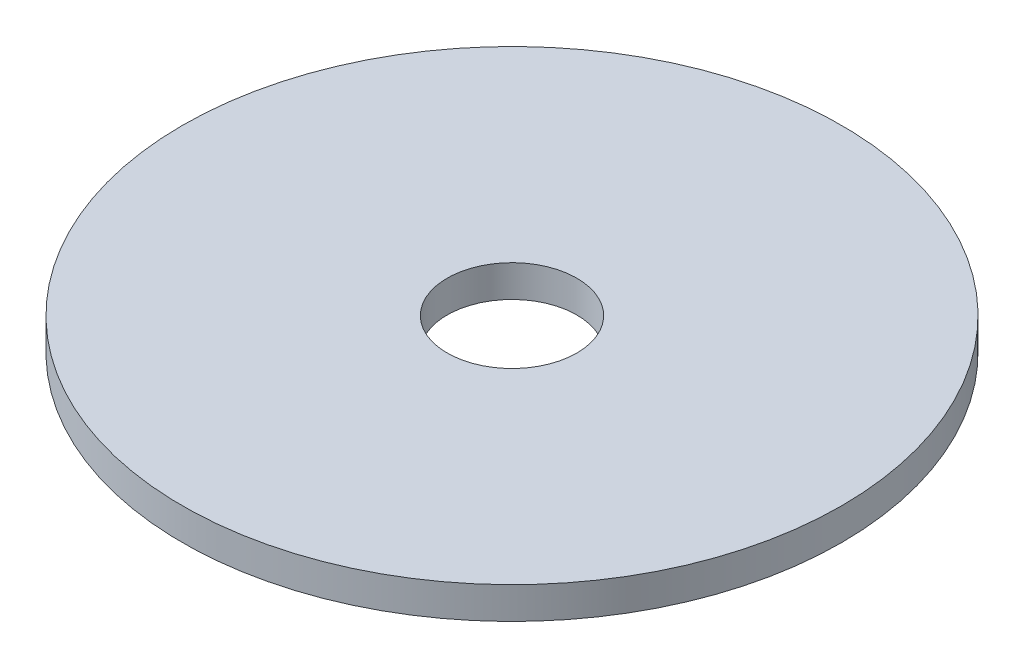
ISO-10303-21;
HEADER;
FILE_DESCRIPTION(('STEP AP214'),'2;1');
FILE_NAME('part.step','',(''),(''),'','','');
FILE_SCHEMA(('AUTOMOTIVE_DESIGN { 1 0 10303 214 1 1 1 1 }'));
ENDSEC;
DATA;
#1=APPLICATION_CONTEXT('core data for automotive mechanical design processes');
#2=APPLICATION_PROTOCOL_DEFINITION('international standard','automotive_design',2000,#1);
#3=PRODUCT_CONTEXT('',#1,'mechanical');
#4=PRODUCT('Part','Part','',(#3));
#5=PRODUCT_RELATED_PRODUCT_CATEGORY('part','',(#4));
#6=PRODUCT_DEFINITION_FORMATION('','',#4);
#7=PRODUCT_DEFINITION_CONTEXT('part definition',#1,'design');
#8=PRODUCT_DEFINITION('design','',#6,#7);
#9=PRODUCT_DEFINITION_SHAPE('','',#8);
#10=(LENGTH_UNIT() NAMED_UNIT(*) SI_UNIT(.MILLI.,.METRE.));
#11=(NAMED_UNIT(*) PLANE_ANGLE_UNIT() SI_UNIT($,.RADIAN.));
#12=(NAMED_UNIT(*) SI_UNIT($,.STERADIAN.) SOLID_ANGLE_UNIT());
#13=UNCERTAINTY_MEASURE_WITH_UNIT(LENGTH_MEASURE(1.E-05),#10,'distance_accuracy_value','');
#14=(GEOMETRIC_REPRESENTATION_CONTEXT(3) GLOBAL_UNCERTAINTY_ASSIGNED_CONTEXT((#13)) GLOBAL_UNIT_ASSIGNED_CONTEXT((#10,
#11,#12)) REPRESENTATION_CONTEXT('',''));
#15=CARTESIAN_POINT('',(0.,0.,0.));
#16=DIRECTION('',(0.,0.,1.));
#17=DIRECTION('',(1.,0.,0.));
#18=AXIS2_PLACEMENT_3D('',#15,#16,#17);
#19=CARTESIAN_POINT('',(0.,-3.,0.));
#20=DIRECTION('',(0.,1.,0.));
#21=DIRECTION('',(0.,0.,1.));
#22=AXIS2_PLACEMENT_3D('',#19,#20,#21);
#23=CYLINDRICAL_SURFACE('',#22,6.1);
#24=CARTESIAN_POINT('',(0.,-3.,0.));
#25=DIRECTION('',(0.,1.,0.));
#26=DIRECTION('',(1.,0.,0.));
#27=AXIS2_PLACEMENT_3D('',#24,#25,#26);
#28=CIRCLE('',#27,6.1);
#29=CARTESIAN_POINT('',(6.1,-3.,0.));
#30=VERTEX_POINT('',#29);
#31=EDGE_CURVE('E8',#30,#30,#28,.T.);
#32=ORIENTED_EDGE('',*,*,#31,.F.);
#33=EDGE_LOOP('',(#32));
#34=FACE_BOUND('',#33,.T.);
#35=CARTESIAN_POINT('',(0.,0.,0.));
#36=DIRECTION('',(0.,1.,0.));
#37=DIRECTION('',(1.,0.,0.));
#38=AXIS2_PLACEMENT_3D('',#35,#36,#37);
#39=CIRCLE('',#38,6.1);
#40=CARTESIAN_POINT('',(6.1,0.,0.));
#41=VERTEX_POINT('',#40);
#42=EDGE_CURVE('E23',#41,#41,#39,.T.);
#43=ORIENTED_EDGE('',*,*,#42,.T.);
#44=EDGE_LOOP('',(#43));
#45=FACE_BOUND('',#44,.T.);
#46=ADVANCED_FACE('F12',(#34,#45),#23,.F.);
#47=CARTESIAN_POINT('',(0.,-3.,0.));
#48=DIRECTION('',(0.,1.,0.));
#49=DIRECTION('',(0.,0.,1.));
#50=AXIS2_PLACEMENT_3D('',#47,#48,#49);
#51=CYLINDRICAL_SURFACE('',#50,31.);
#52=CARTESIAN_POINT('',(0.,-3.,0.));
#53=DIRECTION('',(0.,1.,0.));
#54=DIRECTION('',(1.,0.,0.));
#55=AXIS2_PLACEMENT_3D('',#52,#53,#54);
#56=CIRCLE('',#55,31.);
#57=CARTESIAN_POINT('',(31.,-3.,0.));
#58=VERTEX_POINT('',#57);
#59=EDGE_CURVE('E19',#58,#58,#56,.T.);
#60=ORIENTED_EDGE('',*,*,#59,.T.);
#61=EDGE_LOOP('',(#60));
#62=FACE_BOUND('',#61,.T.);
#63=CARTESIAN_POINT('',(0.,0.,0.));
#64=DIRECTION('',(0.,1.,0.));
#65=DIRECTION('',(1.,0.,0.));
#66=AXIS2_PLACEMENT_3D('',#63,#64,#65);
#67=CIRCLE('',#66,31.);
#68=CARTESIAN_POINT('',(31.,0.,0.));
#69=VERTEX_POINT('',#68);
#70=EDGE_CURVE('E28',#69,#69,#67,.T.);
#71=ORIENTED_EDGE('',*,*,#70,.F.);
#72=EDGE_LOOP('',(#71));
#73=FACE_BOUND('',#72,.T.);
#74=ADVANCED_FACE('F14',(#62,#73),#51,.T.);
#75=CARTESIAN_POINT('',(0.,-3.,0.));
#76=DIRECTION('',(0.,1.,0.));
#77=DIRECTION('',(0.,0.,1.));
#78=AXIS2_PLACEMENT_3D('',#75,#76,#77);
#79=PLANE('',#78);
#80=ORIENTED_EDGE('',*,*,#31,.T.);
#81=EDGE_LOOP('',(#80));
#82=FACE_BOUND('',#81,.T.);
#83=ORIENTED_EDGE('',*,*,#59,.F.);
#84=EDGE_LOOP('',(#83));
#85=FACE_BOUND('',#84,.T.);
#86=ADVANCED_FACE('F40',(#82,#85),#79,.F.);
#87=CARTESIAN_POINT('',(0.,0.,0.));
#88=DIRECTION('',(0.,1.,0.));
#89=DIRECTION('',(0.,0.,1.));
#90=AXIS2_PLACEMENT_3D('',#87,#88,#89);
#91=PLANE('',#90);
#92=ORIENTED_EDGE('',*,*,#42,.F.);
#93=EDGE_LOOP('',(#92));
#94=FACE_BOUND('',#93,.T.);
#95=ORIENTED_EDGE('',*,*,#70,.T.);
#96=EDGE_LOOP('',(#95));
#97=FACE_BOUND('',#96,.T.);
#98=ADVANCED_FACE('F37',(#94,#97),#91,.T.);
#99=CLOSED_SHELL('',(#46,#74,#86,#98));
#100=MANIFOLD_SOLID_BREP('B1',#99);
#101=ADVANCED_BREP_SHAPE_REPRESENTATION('',(#18,#100),#14);
#102=SHAPE_DEFINITION_REPRESENTATION(#9,#101);
ENDSEC;
END-ISO-10303-21;
